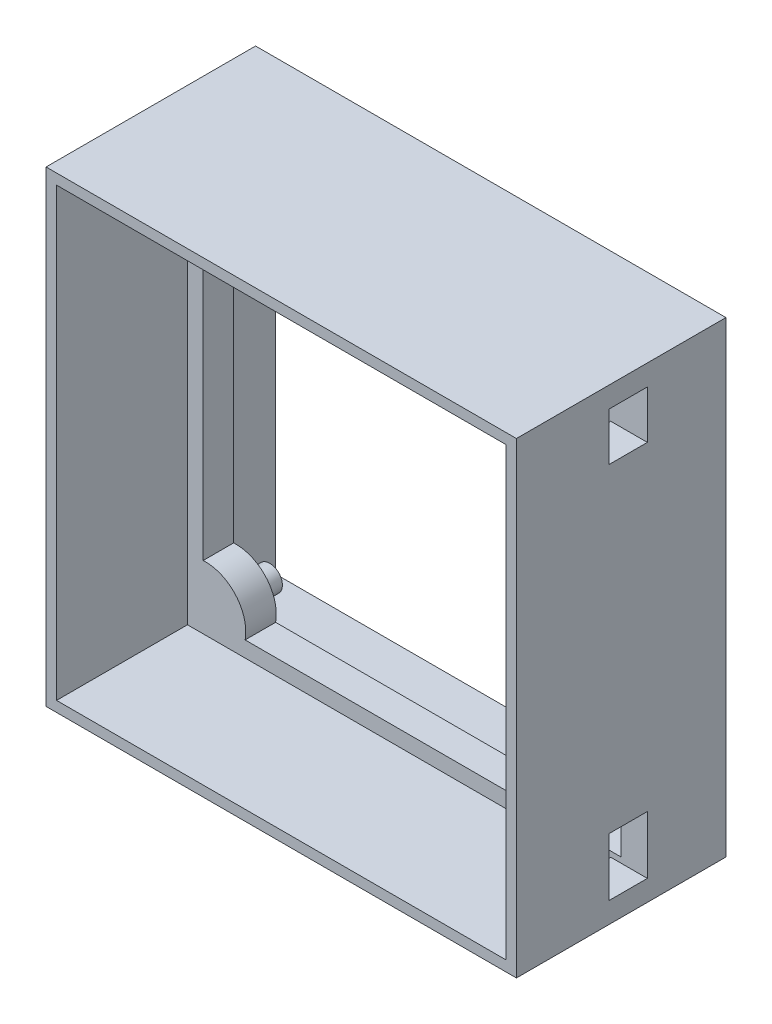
from build123d import *

# Parameters (mm, degrees)
SKETCH1_W           = 89.8
SKETCH1_H           = 89.2
SKETCH1_W_2         = 79.8
SKETCH1_H_2         = 79.2
BOSS_EXTRUDE1_DEPTH = 40
BOSS_EXTRUDE2_DEPTH = 30.82
SKETCH3_W           = 10
SKETCH3_H           = 9.532981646
BOSS_EXTRUDE3_DEPTH = 30.82
SKETCH4_W           = 79.8
SKETCH4_H           = 79.2
CUT_EXTRUDE1_DEPTH  = 25
SKETCH6_R           = 2.25
BOSS_EXTRUDE4_DEPTH = 2.5
CUT_EXTRUDE2_DEPTH  = 18
BOSS_EXTRUDE5_START = -8.32
SKETCH8_R           = 2.4
SKETCH8_R_2         = 2.25
BOSS_EXTRUDE5_DEPTH = 8.32
SKETCH9_W           = 82.2
SKETCH9_H           = 81.6
SKETCH9_W_2         = 79.8
SKETCH9_H_2         = 79.2
CUT_EXTRUDE3_DEPTH  = 9.18
SKETCH10_W          = 85.8
SKETCH10_H          = 85.2
SKETCH10_W_2        = 79.8
SKETCH10_H_2        = 79.2
CUT_EXTRUDE4_DEPTH  = 25
SKETCH11_W          = 7.33
SKETCH11_H          = 9.17
SKETCH11_W_2        = 7.3
SKETCH11_H_2        = 11.06
CUT_EXTRUDE5_DEPTH  = 6
BOSS_EXTRUDE6_DEPTH = 5


with BuildPart() as part:
    # Sketch1 → Boss-Extrude1 (new body)
    with BuildSketch(Plane.XY):
        Rectangle(SKETCH1_W, SKETCH1_H)
        Rectangle(SKETCH1_W_2, SKETCH1_H_2, mode=Mode.SUBTRACT)
    extrude(amount=BOSS_EXTRUDE1_DEPTH)

    # Sketch2 → Boss-Extrude2 (add)
    with BuildSketch(Plane.XY.offset(40)):
        with BuildLine():
            ThreePointArc((-39.9, 30.465482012), (-32.754132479, 32.277842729), (-31.897343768, 39.6))
            Line((-31.897343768, 39.6), (-39.9, 39.6))
            Line((-39.9, 39.6), (-39.9, 30.465482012))
        make_face()
        with BuildLine():
            Line((39.9, 39.6), (31.897343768, 39.6))
            ThreePointArc((31.897343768, 39.6), (32.754132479, 32.277842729), (39.9, 30.465482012))
            Line((39.9, 30.465482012), (39.9, 39.6))
        make_face()
        with BuildLine():
            ThreePointArc((-31.897343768, -39.6), (-32.754132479, -32.277842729), (-39.9, -30.465482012))
            Line((-39.9, -30.465482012), (-39.9, -39.6))
            Line((-39.9, -39.6), (-31.897343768, -39.6))
        make_face()
    extrude(amount=-BOSS_EXTRUDE2_DEPTH)


with BuildPart() as body_2:
    # Sketch3 → Boss-Extrude3 (new body)
    with BuildSketch(Plane.XY.offset(40)):
        with Locations((25.704042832, -34.833509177)):
            Rectangle(SKETCH3_W, SKETCH3_H)
    extrude(amount=-BOSS_EXTRUDE3_DEPTH)


with BuildPart() as cut_extrude1_tool:
    # Sketch4 → Cut-Extrude1 (new body)
    with BuildSketch(Plane.XY.offset(40)):
        Rectangle(SKETCH4_W, SKETCH4_H)
    extrude(amount=-CUT_EXTRUDE1_DEPTH)


with BuildPart() as part_1:
    add(part.part)

    # Cut-Extrude1: cut by cut_extrude1_tool
    add(cut_extrude1_tool.part, mode=Mode.SUBTRACT)



with BuildPart() as body_2_1:
    add(body_2.part)

    # Cut-Extrude1: cut by cut_extrude1_tool
    add(cut_extrude1_tool.part, mode=Mode.SUBTRACT)


with BuildPart() as part_2:
    add(part_1.part)

    add(body_2_1.part)  # Boss-Extrude4 merges body 2
    # Sketch6 → Boss-Extrude4 (add)
    with BuildSketch(Plane(origin=(0, 0, 9.18), x_dir=(-1, 0, 0), z_dir=(0, 0, -1))):
        with Locations(Location((-36, 35.6, 0), (0, 0, 180))):
            Circle(SKETCH6_R)
        with Locations(Location((35.8, 35.4, 0), (0, 0, 180))):
            Circle(SKETCH6_R)
        with Locations(Location((35.5, -35.3, 0), (0, 0, 180))):
            Circle(SKETCH6_R)
        with Locations(Location((-26.2, -34.8, 0), (0, 0, 180))):
            Circle(SKETCH6_R)
    extrude(amount=BOSS_EXTRUDE4_DEPTH)

    # Sketch7 → Cut-Extrude2 (cut)
    with BuildSketch(Plane.XY.offset(15)):
        with BuildLine():
            ThreePointArc((-31.897343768, 39.6), (-32.754132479, 32.277842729), (-39.9, 30.465482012))
            ThreePointArc((-39.9, 30.465482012), (-33.690764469, 33.098416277), (-31.897343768, 39.6))
        make_face()
        with BuildLine():
            ThreePointArc((-31.897343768, -39.6), (-33.690764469, -33.098416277), (-39.9, -30.465482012))
            ThreePointArc((-39.9, -30.465482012), (-32.754132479, -32.277842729), (-31.897343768, -39.6))
        make_face()
    extrude(amount=-CUT_EXTRUDE2_DEPTH, mode=Mode.SUBTRACT)

    # Sketch8 → Boss-Extrude5 (add)
    # profile 1 of 4: a face of its own
    with BuildSketch(Plane(origin=(0, 0, 6.68), x_dir=(-1, 0, 0), z_dir=(0, 0, -1)).offset(BOSS_EXTRUDE5_START)):
        with Locations((-26.2, -34.8)):
            Circle(SKETCH8_R)
        with Locations((-26.2, -34.8)):
            Circle(SKETCH8_R_2, mode=Mode.SUBTRACT)
    # profile 2 of 4: a face of its own
    with BuildSketch(Plane(origin=(0, 0, 6.68), x_dir=(-1, 0, 0), z_dir=(0, 0, -1)).offset(BOSS_EXTRUDE5_START)):
        with Locations((-36, 35.6)):
            Circle(SKETCH8_R)
    # profile 3 of 4: a face of its own
    with BuildSketch(Plane(origin=(0, 0, 6.68), x_dir=(-1, 0, 0), z_dir=(0, 0, -1)).offset(BOSS_EXTRUDE5_START)):
        with Locations((35.8, 35.4)):
            Circle(SKETCH8_R)
    # profile 4 of 4: a face of its own
    with BuildSketch(Plane(origin=(0, 0, 6.68), x_dir=(-1, 0, 0), z_dir=(0, 0, -1)).offset(BOSS_EXTRUDE5_START)):
        with Locations((35.5, -35.3)):
            Circle(SKETCH8_R)
    extrude(amount=BOSS_EXTRUDE5_DEPTH)

    # Sketch9 → Cut-Extrude3 (cut)
    with BuildSketch(Plane(origin=(0, 0, 0), x_dir=(-1, 0, 0), z_dir=(0, 0, -1))):
        Rectangle(SKETCH9_W, SKETCH9_H)
        Rectangle(SKETCH9_W_2, SKETCH9_H_2, mode=Mode.SUBTRACT)
    extrude(amount=-CUT_EXTRUDE3_DEPTH, mode=Mode.SUBTRACT)

    # Sketch10 → Cut-Extrude4 (cut)
    with BuildSketch(Plane.XY.offset(40)):
        Rectangle(SKETCH10_W, SKETCH10_H)
        Rectangle(SKETCH10_W_2, SKETCH10_H_2, mode=Mode.SUBTRACT)
    extrude(amount=-CUT_EXTRUDE4_DEPTH, mode=Mode.SUBTRACT)

    # Sketch11 → Cut-Extrude5 (cut)
    with BuildSketch(Plane.ZY.offset(-42.9)):
        with Locations((18.665, 36.045)):
            Rectangle(SKETCH11_W, SKETCH11_H)
        with Locations((18.65, -35.1)):
            Rectangle(SKETCH11_W_2, SKETCH11_H_2)
    extrude(amount=-CUT_EXTRUDE5_DEPTH, mode=Mode.SUBTRACT)

    # Sketch12 → Boss-Extrude6 (add)
    with BuildSketch(Plane.ZY.offset(-42.9)):
        Polygon((15, 42.63), (15, 40.63), (22.33, 40.63), (22.33, 31.46), (15, 31.46), (15, 29.46), (24.33, 29.46), (24.33, 42.63), align=None)
        Polygon((15, -27.57), (15, -29.57), (22.3, -29.57), (22.3, -40.63), (15, -40.63), (15, -42.63), (24.3, -42.63), (24.3, -27.57), align=None)
    extrude(amount=BOSS_EXTRUDE6_DEPTH)


solid = part_2.part
